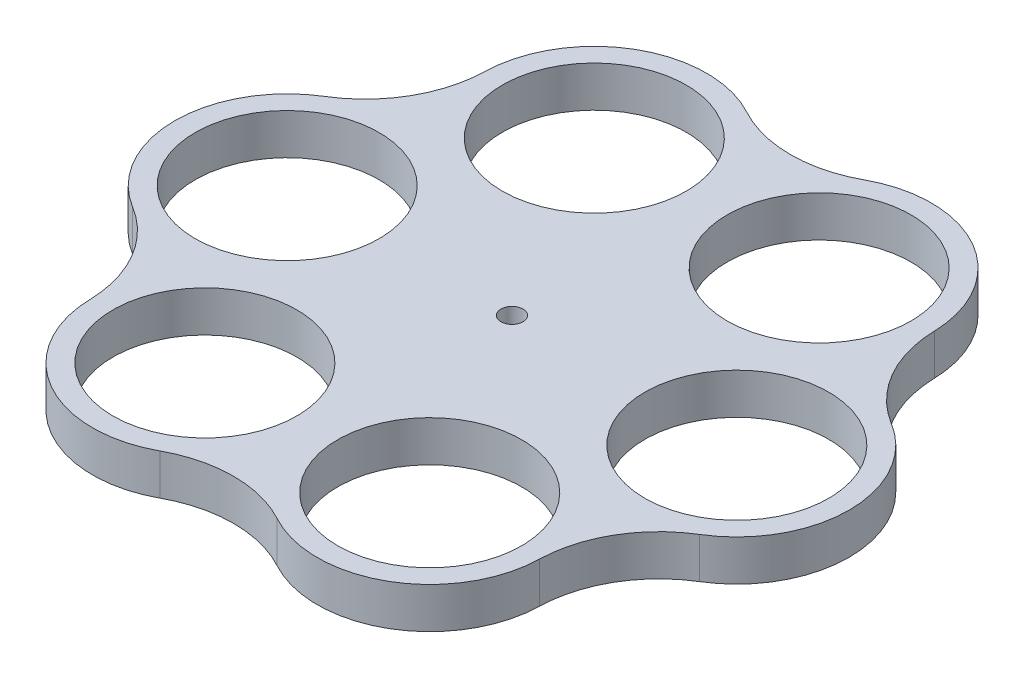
from build123d import *

# Parameters (mm, degrees)
SKETCH1_R           = 22.5
SKETCH1_R_2         = 2.7
BOSS_EXTRUDE1_DEPTH = 10


with BuildPart() as part:
    # Sketch1 → Boss-Extrude1 (new body)
    with BuildSketch(Plane(origin=(0, 0, 0), x_dir=(1, 0, 0), z_dir=(0, 1, 0))):
        with BuildLine():
            ThreePointArc((54.991457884, 48.316775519), (41.25, 71.447095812), (14.347826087, 71.782387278))
            ThreePointArc((14.347826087, 71.782387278), (0, 68.1289219), (-14.347826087, 71.782387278))
            ThreePointArc((-14.347826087, 71.782387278), (-41.25, 71.447095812), (-54.991457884, 48.316775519))
            ThreePointArc((-54.991457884, 48.316775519), (-59.001377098, 34.06446095), (-69.339283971, 23.465611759))
            ThreePointArc((-69.339283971, 23.465611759), (-82.5, 0), (-69.339283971, -23.465611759))
            ThreePointArc((-69.339283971, -23.465611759), (-59.001377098, -34.06446095), (-54.991457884, -48.316775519))
            ThreePointArc((-54.991457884, -48.316775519), (-41.25, -71.447095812), (-14.347826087, -71.782387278))
            ThreePointArc((-14.347826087, -71.782387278), (0, -68.1289219), (14.347826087, -71.782387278))
            ThreePointArc((14.347826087, -71.782387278), (41.25, -71.447095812), (54.991457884, -48.316775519))
            ThreePointArc((54.991457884, -48.316775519), (59.001377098, -34.06446095), (69.339283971, -23.465611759))
            ThreePointArc((69.339283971, -23.465611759), (82.5, 0), (69.339283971, 23.465611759))
            ThreePointArc((69.339283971, 23.465611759), (59.001377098, 34.06446095), (54.991457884, 48.316775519))
        make_face()
        with Locations(Location((27.5, 47.631397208, 0), (0, 0, 270))):
            Circle(SKETCH1_R, mode=Mode.SUBTRACT)
        with Locations(Location((-27.5, 47.631397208, 0), (0, 0, 270))):
            Circle(SKETCH1_R, mode=Mode.SUBTRACT)
        with Locations(Location((-55, 0, 0), (0, 0, 270))):
            Circle(SKETCH1_R, mode=Mode.SUBTRACT)
        with Locations(Location((-27.5, -47.631397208, 0), (0, 0, 270))):
            Circle(SKETCH1_R, mode=Mode.SUBTRACT)
        with Locations(Location((27.5, -47.631397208, 0), (0, 0, 270))):
            Circle(SKETCH1_R, mode=Mode.SUBTRACT)
        with Locations(Location((55, 0, 0), (0, 0, 270))):
            Circle(SKETCH1_R, mode=Mode.SUBTRACT)
        with Locations(Location((0, 0, 0), (0, 0, 270))):
            Circle(SKETCH1_R_2, mode=Mode.SUBTRACT)
    extrude(amount=BOSS_EXTRUDE1_DEPTH)


solid = part.part
